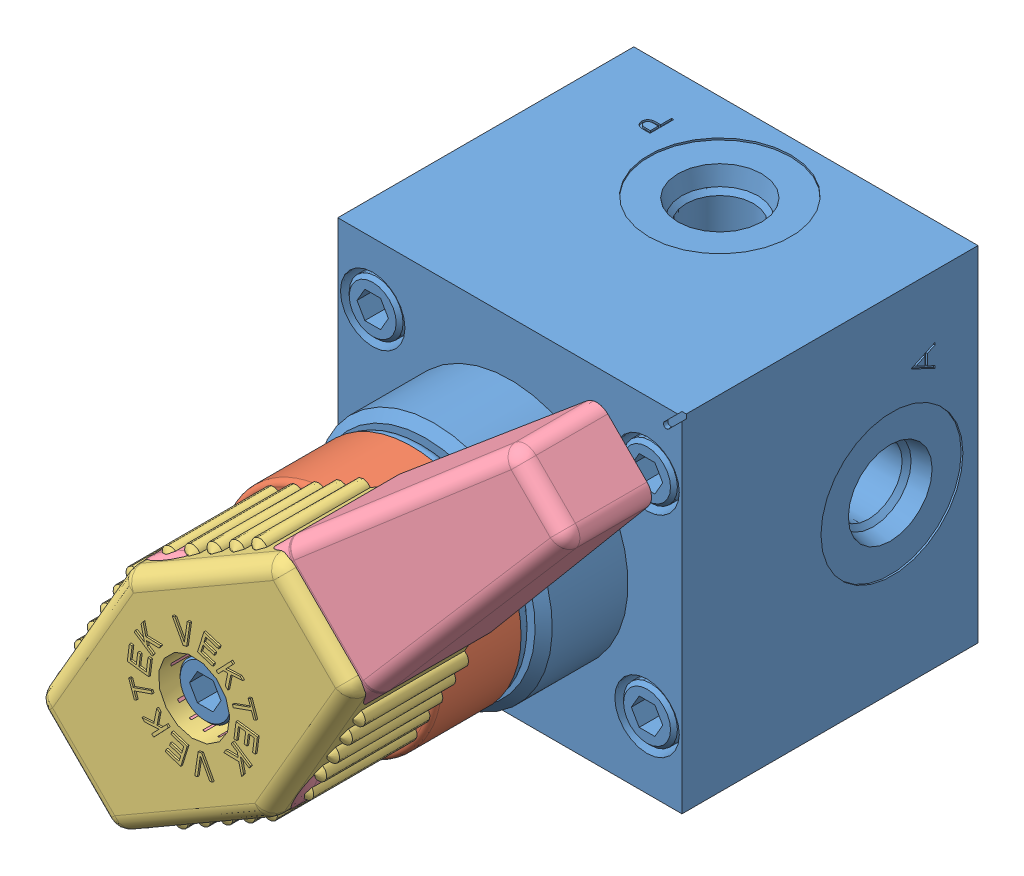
SolidWorks assembly ILC71347401.SLDASM, configuration Default (file format 5000). Lengths in mm.
Overall size (58.16 58.16 90.87).
4 component instances, 4 part files, 9 mates.
Components (placement in the parent):
- ILC71347401_BODY-1: ILC71347401_BODY.sldprt [Default] at (14.7983 -31.796 -34.3833) size (50.8 50.8 88.65)
- ILC71347401_ADAPTER-1: ILC71347401_ADAPTER.sldprt [Default] at (-10.6017 -6.396 44.9917) x (0 0 -1) z (1 0 0) size (22.23 32.26 32.26)
- 85600903-1: 85600903.sldprt [Default] at (-10.6017 -6.396 55.9137) x (0.707107 0.707107 0) z (0.707107 -0.707107 0) size (51.61 19.62 30.64)
- 85600902-1: 85600902.SLDPRT [Default] at (-10.6017 -6.396 36.8637) x (0 0 1) z (0.707107 -0.707107 0) size (17.76 89.76 30.23) (hidden)
Mates (geometry in assembly coordinates):
- Concentric1: concentric anti-aligned: cylinder of ILC71347401_BODY-1 through (-10.6017 -6.396 54.9803) axis (0 0 -1) radius 3.9624; cylinder of ILC71347401_ADAPTER-1 through (-10.6017 -6.396 16.6872) axis (0 0 1) radius 6.35
- Coincident1: coincident anti-aligned: plane of ILC71347401_BODY-1 through (-10.6017 -6.396 22.7667) normal (0 0 1); plane of ILC71347401_ADAPTER-1 through (-10.6017 -6.396 22.7667) normal (0 0 -1)
- Parallel1: parallel anti-aligned: plane of ILC71347401_BODY-1 through (14.1633 19.004 9.3047) normal (0.707107 -0.707107 0); plane of ILC71347401_ADAPTER-1 through (-21.5999 -1.8404 44.9917) normal (-0.707107 0.707107 0)
- Concentric2: concentric anti-aligned: cylinder of ILC71347401_BODY-1 through (-10.6017 -6.396 54.9803) axis (0 0 -1) radius 2.413; cylinder of 85600903-1 through (-10.6017 -6.396 27.6172) axis (0 0 1) radius 2.5781
- Parallel2: parallel anti-aligned: plane of ILC71347401_ADAPTER-1 through (-21.5999 -1.8404 44.9917) normal (-0.707107 0.707107 0); plane of 85600903-1 through (-21.7777 -1.7668 36.8637) normal (0.707107 -0.707107 0)
- Coincident4: coincident anti-aligned: plane of ILC71347401_ADAPTER-1 through (-10.6017 -6.396 44.9917) normal (0 0 1); plane of 85600903-1 through (-10.6017 -6.396 44.9917) normal (0 0 -1)
- Concentric3: concentric anti-aligned: cylinder of ILC71347401_BODY-1 through (-10.6017 -6.396 54.9803) axis (0 0 -1) radius 3.9624; cylinder of 85600902-1 through (-10.6017 -6.396 40.8007) axis (0 0 1) radius 5.2705
- Parallel3: parallel anti-aligned: plane of ILC71347401_ADAPTER-1 through (-21.5999 -1.8404 44.9917) normal (-0.707107 0.707107 0); plane of 85600902-1 through (-21.7777 -1.7668 36.8637) normal (0.707107 -0.707107 0)
- Coincident6: coincident anti-aligned: plane of ILC71347401_ADAPTER-1 through (-10.6017 -6.396 44.9917) normal (0 0 1); plane of 85600902-1 through (-10.6017 -6.396 44.9917) normal (0 0 -1)
